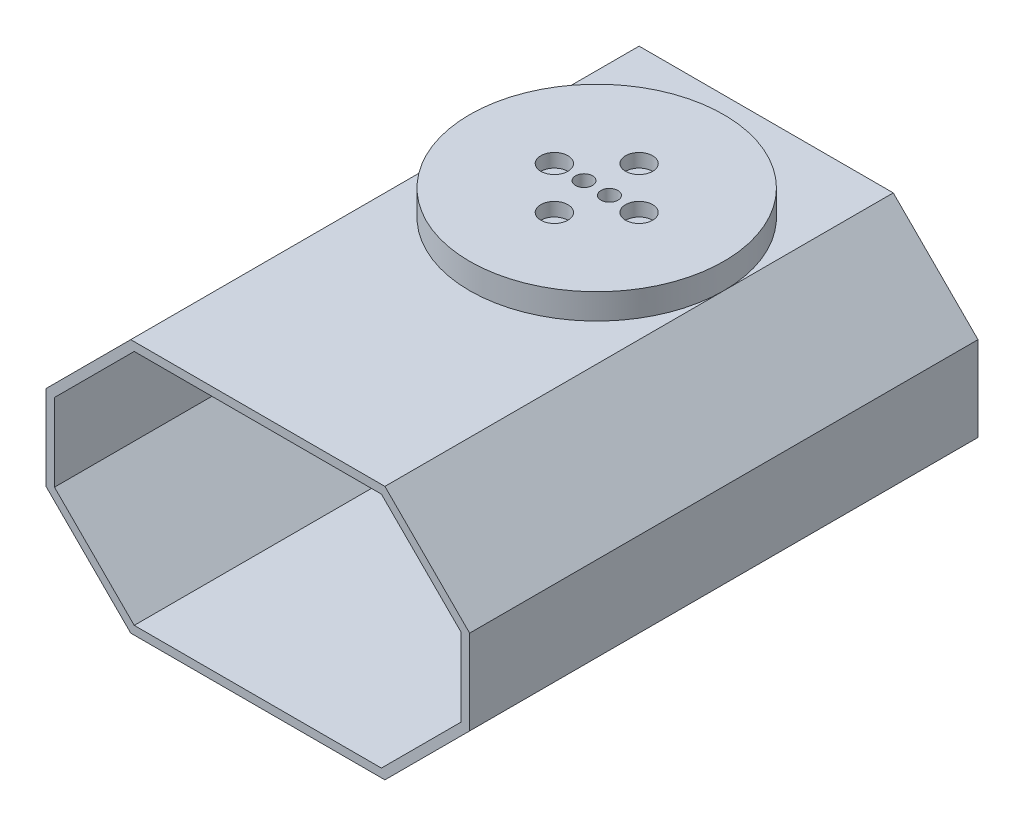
ISO-10303-21;
HEADER;
FILE_DESCRIPTION(('STEP AP214'),'2;1');
FILE_NAME('part.step','',(''),(''),'','','');
FILE_SCHEMA(('AUTOMOTIVE_DESIGN { 1 0 10303 214 1 1 1 1 }'));
ENDSEC;
DATA;
#1=APPLICATION_CONTEXT('core data for automotive mechanical design processes');
#2=APPLICATION_PROTOCOL_DEFINITION('international standard','automotive_design',2000,#1);
#3=PRODUCT_CONTEXT('',#1,'mechanical');
#4=PRODUCT('Part','Part','',(#3));
#5=PRODUCT_RELATED_PRODUCT_CATEGORY('part','',(#4));
#6=PRODUCT_DEFINITION_FORMATION('','',#4);
#7=PRODUCT_DEFINITION_CONTEXT('part definition',#1,'design');
#8=PRODUCT_DEFINITION('design','',#6,#7);
#9=PRODUCT_DEFINITION_SHAPE('','',#8);
#10=(LENGTH_UNIT() NAMED_UNIT(*) SI_UNIT(.MILLI.,.METRE.));
#11=(NAMED_UNIT(*) PLANE_ANGLE_UNIT() SI_UNIT($,.RADIAN.));
#12=(NAMED_UNIT(*) SI_UNIT($,.STERADIAN.) SOLID_ANGLE_UNIT());
#13=UNCERTAINTY_MEASURE_WITH_UNIT(LENGTH_MEASURE(1.E-05),#10,'distance_accuracy_value','');
#14=(GEOMETRIC_REPRESENTATION_CONTEXT(3) GLOBAL_UNCERTAINTY_ASSIGNED_CONTEXT((#13)) GLOBAL_UNIT_ASSIGNED_CONTEXT((#10,
#11,#12)) REPRESENTATION_CONTEXT('',''));
#15=CARTESIAN_POINT('',(0.,0.,0.));
#16=DIRECTION('',(0.,0.,1.));
#17=DIRECTION('',(1.,0.,0.));
#18=AXIS2_PLACEMENT_3D('',#15,#16,#17);
#19=CARTESIAN_POINT('',(0.,0.,0.));
#20=DIRECTION('',(0.,0.,-1.));
#21=DIRECTION('',(-1.,0.,0.));
#22=AXIS2_PLACEMENT_3D('',#19,#20,#21);
#23=PLANE('',#22);
#24=CARTESIAN_POINT('',(0.,10.,0.));
#25=DIRECTION('',(0.,0.,-1.));
#26=DIRECTION('',(-1.,0.,0.));
#27=AXIS2_PLACEMENT_3D('',#24,#25,#26);
#28=CIRCLE('',#27,2.5);
#29=CARTESIAN_POINT('',(-2.5,10.,0.));
#30=VERTEX_POINT('',#29);
#31=EDGE_CURVE('E456',#30,#30,#28,.T.);
#32=ORIENTED_EDGE('',*,*,#31,.F.);
#33=EDGE_LOOP('',(#32));
#34=FACE_BOUND('',#33,.T.);
#35=CARTESIAN_POINT('',(0.,-10.,0.));
#36=DIRECTION('',(0.,0.,-1.));
#37=DIRECTION('',(-1.,0.,0.));
#38=AXIS2_PLACEMENT_3D('',#35,#36,#37);
#39=CIRCLE('',#38,2.5);
#40=CARTESIAN_POINT('',(-2.5,-10.,0.));
#41=VERTEX_POINT('',#40);
#42=EDGE_CURVE('E209',#41,#41,#39,.T.);
#43=ORIENTED_EDGE('',*,*,#42,.F.);
#44=EDGE_LOOP('',(#43));
#45=FACE_BOUND('',#44,.T.);
#46=DIRECTION('',(0.,1.,0.));
#47=VECTOR('',#46,1.);
#48=CARTESIAN_POINT('',(25.,-15.,0.));
#49=LINE('',#48,#47);
#50=CARTESIAN_POINT('',(25.,-5.00000000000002,0.));
#51=VERTEX_POINT('',#50);
#52=CARTESIAN_POINT('',(25.,4.99999999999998,0.));
#53=VERTEX_POINT('',#52);
#54=EDGE_CURVE('E310',#51,#53,#49,.T.);
#55=ORIENTED_EDGE('',*,*,#54,.F.);
#56=DIRECTION('',(0.707106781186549,0.707106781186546,0.));
#57=VECTOR('',#56,1.);
#58=CARTESIAN_POINT('',(15.,-15.,0.));
#59=LINE('',#58,#57);
#60=CARTESIAN_POINT('',(15.,-15.,0.));
#61=VERTEX_POINT('',#60);
#62=EDGE_CURVE('E359',#51,#61,#59,.F.);
#63=ORIENTED_EDGE('',*,*,#62,.T.);
#64=DIRECTION('',(1.,0.,0.));
#65=VECTOR('',#64,1.);
#66=CARTESIAN_POINT('',(-25.,-15.,0.));
#67=LINE('',#66,#65);
#68=CARTESIAN_POINT('',(-15.,-15.,0.));
#69=VERTEX_POINT('',#68);
#70=EDGE_CURVE('E329',#69,#61,#67,.T.);
#71=ORIENTED_EDGE('',*,*,#70,.F.);
#72=DIRECTION('',(0.707106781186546,-0.707106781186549,0.));
#73=VECTOR('',#72,1.);
#74=CARTESIAN_POINT('',(-15.,-15.,0.));
#75=LINE('',#74,#73);
#76=CARTESIAN_POINT('',(-25.,-4.99999999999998,0.));
#77=VERTEX_POINT('',#76);
#78=EDGE_CURVE('E357',#69,#77,#75,.F.);
#79=ORIENTED_EDGE('',*,*,#78,.T.);
#80=DIRECTION('',(0.,-1.,0.));
#81=VECTOR('',#80,1.);
#82=CARTESIAN_POINT('',(-25.,-15.,0.));
#83=LINE('',#82,#81);
#84=CARTESIAN_POINT('',(-25.,5.00000000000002,0.));
#85=VERTEX_POINT('',#84);
#86=EDGE_CURVE('E344',#85,#77,#83,.T.);
#87=ORIENTED_EDGE('',*,*,#86,.F.);
#88=DIRECTION('',(-0.707106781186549,-0.707106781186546,0.));
#89=VECTOR('',#88,1.);
#90=CARTESIAN_POINT('',(-15.,15.,0.));
#91=LINE('',#90,#89);
#92=CARTESIAN_POINT('',(-15.,15.,0.));
#93=VERTEX_POINT('',#92);
#94=EDGE_CURVE('E355',#85,#93,#91,.F.);
#95=ORIENTED_EDGE('',*,*,#94,.T.);
#96=DIRECTION('',(-1.,0.,0.));
#97=VECTOR('',#96,1.);
#98=CARTESIAN_POINT('',(-25.,15.,0.));
#99=LINE('',#98,#97);
#100=CARTESIAN_POINT('',(15.,15.,0.));
#101=VERTEX_POINT('',#100);
#102=EDGE_CURVE('E341',#101,#93,#99,.T.);
#103=ORIENTED_EDGE('',*,*,#102,.F.);
#104=DIRECTION('',(-0.707106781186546,0.707106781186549,0.));
#105=VECTOR('',#104,1.);
#106=CARTESIAN_POINT('',(15.,15.,0.));
#107=LINE('',#106,#105);
#108=EDGE_CURVE('E353',#101,#53,#107,.F.);
#109=ORIENTED_EDGE('',*,*,#108,.T.);
#110=EDGE_LOOP('',(#55,#63,#71,#79,#87,#95,#103,#109));
#111=FACE_BOUND('',#110,.T.);
#112=DIRECTION('',(0.,-1.,0.));
#113=VECTOR('',#112,1.);
#114=CARTESIAN_POINT('',(3.,5.45,0.));
#115=LINE('',#114,#113);
#116=CARTESIAN_POINT('',(3.,5.45,0.));
#117=VERTEX_POINT('',#116);
#118=CARTESIAN_POINT('',(3.,-5.45,0.));
#119=VERTEX_POINT('',#118);
#120=EDGE_CURVE('E202',#117,#119,#115,.T.);
#121=ORIENTED_EDGE('',*,*,#120,.F.);
#122=DIRECTION('',(-1.,0.,0.));
#123=VECTOR('',#122,1.);
#124=CARTESIAN_POINT('',(3.,5.45,0.));
#125=LINE('',#124,#123);
#126=CARTESIAN_POINT('',(-3.,5.45,0.));
#127=VERTEX_POINT('',#126);
#128=EDGE_CURVE('E57',#117,#127,#125,.T.);
#129=ORIENTED_EDGE('',*,*,#128,.T.);
#130=DIRECTION('',(0.,-1.,0.));
#131=VECTOR('',#130,1.);
#132=CARTESIAN_POINT('',(-3.,5.45,0.));
#133=LINE('',#132,#131);
#134=CARTESIAN_POINT('',(-3.,-5.45,0.));
#135=VERTEX_POINT('',#134);
#136=EDGE_CURVE('E193',#127,#135,#133,.T.);
#137=ORIENTED_EDGE('',*,*,#136,.T.);
#138=DIRECTION('',(-1.,0.,0.));
#139=VECTOR('',#138,1.);
#140=CARTESIAN_POINT('',(3.,-5.45,0.));
#141=LINE('',#140,#139);
#142=EDGE_CURVE('E199',#119,#135,#141,.T.);
#143=ORIENTED_EDGE('',*,*,#142,.F.);
#144=EDGE_LOOP('',(#121,#129,#137,#143));
#145=FACE_BOUND('',#144,.T.);
#146=ADVANCED_FACE('F41',(#34,#45,#111,#145),#23,.T.);
#147=CARTESIAN_POINT('',(0.,0.,2.));
#148=DIRECTION('',(0.,0.,1.));
#149=DIRECTION('',(1.,0.,0.));
#150=AXIS2_PLACEMENT_3D('',#147,#148,#149);
#151=PLANE('',#150);
#152=DIRECTION('',(1.,0.,0.));
#153=VECTOR('',#152,1.);
#154=CARTESIAN_POINT('',(14.5857864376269,-14.,2.));
#155=LINE('',#154,#153);
#156=CARTESIAN_POINT('',(-14.5857864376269,-14.,2.));
#157=VERTEX_POINT('',#156);
#158=CARTESIAN_POINT('',(14.5857864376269,-14.,2.));
#159=VERTEX_POINT('',#158);
#160=EDGE_CURVE('E261',#157,#159,#155,.T.);
#161=ORIENTED_EDGE('',*,*,#160,.T.);
#162=DIRECTION('',(0.707106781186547,0.707106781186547,0.));
#163=VECTOR('',#162,1.);
#164=CARTESIAN_POINT('',(24.,-4.58578643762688,2.));
#165=LINE('',#164,#163);
#166=CARTESIAN_POINT('',(24.,-4.58578643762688,2.));
#167=VERTEX_POINT('',#166);
#168=EDGE_CURVE('E264',#159,#167,#165,.T.);
#169=ORIENTED_EDGE('',*,*,#168,.T.);
#170=DIRECTION('',(0.,1.,0.));
#171=VECTOR('',#170,1.);
#172=CARTESIAN_POINT('',(24.,4.58578643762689,2.));
#173=LINE('',#172,#171);
#174=CARTESIAN_POINT('',(24.,4.58578643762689,2.));
#175=VERTEX_POINT('',#174);
#176=EDGE_CURVE('E268',#167,#175,#173,.T.);
#177=ORIENTED_EDGE('',*,*,#176,.T.);
#178=DIRECTION('',(-0.707106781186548,0.707106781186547,0.));
#179=VECTOR('',#178,1.);
#180=CARTESIAN_POINT('',(14.5857864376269,14.,2.));
#181=LINE('',#180,#179);
#182=CARTESIAN_POINT('',(14.5857864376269,14.,2.));
#183=VERTEX_POINT('',#182);
#184=EDGE_CURVE('E271',#175,#183,#181,.T.);
#185=ORIENTED_EDGE('',*,*,#184,.T.);
#186=DIRECTION('',(-1.,0.,0.));
#187=VECTOR('',#186,1.);
#188=CARTESIAN_POINT('',(-14.5857864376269,14.,2.));
#189=LINE('',#188,#187);
#190=CARTESIAN_POINT('',(-14.5857864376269,14.,2.));
#191=VERTEX_POINT('',#190);
#192=EDGE_CURVE('E274',#183,#191,#189,.T.);
#193=ORIENTED_EDGE('',*,*,#192,.T.);
#194=DIRECTION('',(-0.707106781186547,-0.707106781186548,0.));
#195=VECTOR('',#194,1.);
#196=CARTESIAN_POINT('',(-24.,4.58578643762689,2.));
#197=LINE('',#196,#195);
#198=CARTESIAN_POINT('',(-24.,4.58578643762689,2.));
#199=VERTEX_POINT('',#198);
#200=EDGE_CURVE('E277',#191,#199,#197,.T.);
#201=ORIENTED_EDGE('',*,*,#200,.T.);
#202=DIRECTION('',(0.,-1.,0.));
#203=VECTOR('',#202,1.);
#204=CARTESIAN_POINT('',(-24.,4.58578643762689,2.));
#205=LINE('',#204,#203);
#206=CARTESIAN_POINT('',(-24.,-4.5857864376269,2.));
#207=VERTEX_POINT('',#206);
#208=EDGE_CURVE('E280',#199,#207,#205,.T.);
#209=ORIENTED_EDGE('',*,*,#208,.T.);
#210=DIRECTION('',(0.707106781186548,-0.707106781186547,0.));
#211=VECTOR('',#210,1.);
#212=CARTESIAN_POINT('',(-14.5857864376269,-14.,2.));
#213=LINE('',#212,#211);
#214=EDGE_CURVE('E283',#207,#157,#213,.T.);
#215=ORIENTED_EDGE('',*,*,#214,.T.);
#216=EDGE_LOOP('',(#161,#169,#177,#185,#193,#201,#209,#215));
#217=FACE_BOUND('',#216,.T.);
#218=DIRECTION('',(0.,1.,0.));
#219=VECTOR('',#218,1.);
#220=CARTESIAN_POINT('',(-3.,0.,2.));
#221=LINE('',#220,#219);
#222=CARTESIAN_POINT('',(-3.,-5.45,2.));
#223=VERTEX_POINT('',#222);
#224=CARTESIAN_POINT('',(-3.,5.45,2.));
#225=VERTEX_POINT('',#224);
#226=EDGE_CURVE('E50',#223,#225,#221,.T.);
#227=ORIENTED_EDGE('',*,*,#226,.T.);
#228=DIRECTION('',(1.,0.,0.));
#229=VECTOR('',#228,1.);
#230=CARTESIAN_POINT('',(0.,5.45,2.));
#231=LINE('',#230,#229);
#232=CARTESIAN_POINT('',(3.,5.45,2.));
#233=VERTEX_POINT('',#232);
#234=EDGE_CURVE('E11',#225,#233,#231,.T.);
#235=ORIENTED_EDGE('',*,*,#234,.T.);
#236=DIRECTION('',(0.,1.,0.));
#237=VECTOR('',#236,1.);
#238=CARTESIAN_POINT('',(3.,0.,2.));
#239=LINE('',#238,#237);
#240=CARTESIAN_POINT('',(3.,-5.45,2.));
#241=VERTEX_POINT('',#240);
#242=EDGE_CURVE('E386',#241,#233,#239,.T.);
#243=ORIENTED_EDGE('',*,*,#242,.F.);
#244=DIRECTION('',(1.,0.,0.));
#245=VECTOR('',#244,1.);
#246=CARTESIAN_POINT('',(0.,-5.45,2.));
#247=LINE('',#246,#245);
#248=EDGE_CURVE('E388',#223,#241,#247,.T.);
#249=ORIENTED_EDGE('',*,*,#248,.F.);
#250=EDGE_LOOP('',(#227,#235,#243,#249));
#251=FACE_BOUND('',#250,.T.);
#252=ADVANCED_FACE('F391',(#217,#251),#151,.T.);
#253=CARTESIAN_POINT('',(-25.,15.,60.));
#254=DIRECTION('',(0.,-1.,0.));
#255=DIRECTION('',(0.,0.,-1.));
#256=AXIS2_PLACEMENT_3D('',#253,#254,#255);
#257=PLANE('',#256);
#258=CARTESIAN_POINT('',(0.,15.,20.));
#259=DIRECTION('',(0.,1.,0.));
#260=DIRECTION('',(0.,0.,1.));
#261=AXIS2_PLACEMENT_3D('',#258,#259,#260);
#262=CIRCLE('',#261,15.);
#263=CARTESIAN_POINT('',(15.,15.,20.));
#264=VERTEX_POINT('',#263);
#265=CARTESIAN_POINT('',(-15.,15.,20.));
#266=VERTEX_POINT('',#265);
#267=EDGE_CURVE('E253',#264,#266,#262,.T.);
#268=ORIENTED_EDGE('',*,*,#267,.F.);
#269=DIRECTION('',(0.,0.,-1.));
#270=VECTOR('',#269,1.);
#271=CARTESIAN_POINT('',(15.,15.,60.));
#272=LINE('',#271,#270);
#273=EDGE_CURVE('E379',#264,#101,#272,.T.);
#274=ORIENTED_EDGE('',*,*,#273,.T.);
#275=ORIENTED_EDGE('',*,*,#102,.T.);
#276=DIRECTION('',(0.,0.,1.));
#277=VECTOR('',#276,1.);
#278=CARTESIAN_POINT('',(-15.,15.,60.));
#279=LINE('',#278,#277);
#280=EDGE_CURVE('E383',#93,#266,#279,.T.);
#281=ORIENTED_EDGE('',*,*,#280,.T.);
#282=EDGE_LOOP('',(#268,#274,#275,#281));
#283=FACE_BOUND('',#282,.T.);
#284=ADVANCED_FACE('F415',(#283),#257,.F.);
#285=CARTESIAN_POINT('',(25.,-15.,60.));
#286=DIRECTION('',(-1.,0.,0.));
#287=DIRECTION('',(0.,0.,1.));
#288=AXIS2_PLACEMENT_3D('',#285,#286,#287);
#289=PLANE('',#288);
#290=DIRECTION('',(0.,1.,0.));
#291=VECTOR('',#290,1.);
#292=CARTESIAN_POINT('',(25.,-15.,60.));
#293=LINE('',#292,#291);
#294=CARTESIAN_POINT('',(25.,-5.00000000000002,60.));
#295=VERTEX_POINT('',#294);
#296=CARTESIAN_POINT('',(25.,4.99999999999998,60.));
#297=VERTEX_POINT('',#296);
#298=EDGE_CURVE('E325',#295,#297,#293,.T.);
#299=ORIENTED_EDGE('',*,*,#298,.F.);
#300=DIRECTION('',(0.,0.,-1.));
#301=VECTOR('',#300,1.);
#302=CARTESIAN_POINT('',(25.,-5.00000000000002,60.));
#303=LINE('',#302,#301);
#304=EDGE_CURVE('E350',#295,#51,#303,.T.);
#305=ORIENTED_EDGE('',*,*,#304,.T.);
#306=ORIENTED_EDGE('',*,*,#54,.T.);
#307=DIRECTION('',(0.,0.,1.));
#308=VECTOR('',#307,1.);
#309=CARTESIAN_POINT('',(25.,4.99999999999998,60.));
#310=LINE('',#309,#308);
#311=EDGE_CURVE('E338',#53,#297,#310,.T.);
#312=ORIENTED_EDGE('',*,*,#311,.T.);
#313=EDGE_LOOP('',(#299,#305,#306,#312));
#314=FACE_BOUND('',#313,.T.);
#315=ADVANCED_FACE('F480',(#314),#289,.F.);
#316=EDGE_CURVE('E260',#266,#264,#262,.T.);
#317=ORIENTED_EDGE('',*,*,#316,.F.);
#318=CARTESIAN_POINT('',(-15.,15.,60.));
#319=VERTEX_POINT('',#318);
#320=EDGE_CURVE('E382',#266,#319,#279,.T.);
#321=ORIENTED_EDGE('',*,*,#320,.T.);
#322=DIRECTION('',(-1.,0.,0.));
#323=VECTOR('',#322,1.);
#324=CARTESIAN_POINT('',(-25.,15.,60.));
#325=LINE('',#324,#323);
#326=CARTESIAN_POINT('',(15.,15.,60.));
#327=VERTEX_POINT('',#326);
#328=EDGE_CURVE('E328',#327,#319,#325,.T.);
#329=ORIENTED_EDGE('',*,*,#328,.F.);
#330=EDGE_CURVE('E380',#327,#264,#272,.T.);
#331=ORIENTED_EDGE('',*,*,#330,.T.);
#332=EDGE_LOOP('',(#317,#321,#329,#331));
#333=FACE_BOUND('',#332,.T.);
#334=ADVANCED_FACE('F491',(#333),#257,.F.);
#335=CARTESIAN_POINT('',(-25.,-15.,60.));
#336=DIRECTION('',(1.,0.,0.));
#337=DIRECTION('',(0.,0.,-1.));
#338=AXIS2_PLACEMENT_3D('',#335,#336,#337);
#339=PLANE('',#338);
#340=ORIENTED_EDGE('',*,*,#86,.T.);
#341=DIRECTION('',(0.,0.,1.));
#342=VECTOR('',#341,1.);
#343=CARTESIAN_POINT('',(-25.,-4.99999999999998,60.));
#344=LINE('',#343,#342);
#345=CARTESIAN_POINT('',(-25.,-4.99999999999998,60.));
#346=VERTEX_POINT('',#345);
#347=EDGE_CURVE('E377',#77,#346,#344,.T.);
#348=ORIENTED_EDGE('',*,*,#347,.T.);
#349=DIRECTION('',(0.,-1.,0.));
#350=VECTOR('',#349,1.);
#351=CARTESIAN_POINT('',(-25.,-15.,60.));
#352=LINE('',#351,#350);
#353=CARTESIAN_POINT('',(-25.,5.00000000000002,60.));
#354=VERTEX_POINT('',#353);
#355=EDGE_CURVE('E332',#354,#346,#352,.T.);
#356=ORIENTED_EDGE('',*,*,#355,.F.);
#357=DIRECTION('',(0.,0.,-1.));
#358=VECTOR('',#357,1.);
#359=CARTESIAN_POINT('',(-25.,5.00000000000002,60.));
#360=LINE('',#359,#358);
#361=EDGE_CURVE('E374',#354,#85,#360,.T.);
#362=ORIENTED_EDGE('',*,*,#361,.T.);
#363=EDGE_LOOP('',(#340,#348,#356,#362));
#364=FACE_BOUND('',#363,.T.);
#365=ADVANCED_FACE('F557',(#364),#339,.F.);
#366=CARTESIAN_POINT('',(-25.,-15.,60.));
#367=DIRECTION('',(0.,1.,0.));
#368=DIRECTION('',(0.,0.,1.));
#369=AXIS2_PLACEMENT_3D('',#366,#367,#368);
#370=PLANE('',#369);
#371=ORIENTED_EDGE('',*,*,#70,.T.);
#372=DIRECTION('',(0.,0.,1.));
#373=VECTOR('',#372,1.);
#374=CARTESIAN_POINT('',(15.,-15.,60.));
#375=LINE('',#374,#373);
#376=CARTESIAN_POINT('',(15.,-15.,60.));
#377=VERTEX_POINT('',#376);
#378=EDGE_CURVE('E364',#61,#377,#375,.T.);
#379=ORIENTED_EDGE('',*,*,#378,.T.);
#380=DIRECTION('',(1.,0.,0.));
#381=VECTOR('',#380,1.);
#382=CARTESIAN_POINT('',(-25.,-15.,60.));
#383=LINE('',#382,#381);
#384=CARTESIAN_POINT('',(-15.,-15.,60.));
#385=VERTEX_POINT('',#384);
#386=EDGE_CURVE('E335',#385,#377,#383,.T.);
#387=ORIENTED_EDGE('',*,*,#386,.F.);
#388=DIRECTION('',(0.,0.,-1.));
#389=VECTOR('',#388,1.);
#390=CARTESIAN_POINT('',(-15.,-15.,60.));
#391=LINE('',#390,#389);
#392=EDGE_CURVE('E361',#385,#69,#391,.T.);
#393=ORIENTED_EDGE('',*,*,#392,.T.);
#394=EDGE_LOOP('',(#371,#379,#387,#393));
#395=FACE_BOUND('',#394,.T.);
#396=ADVANCED_FACE('F548',(#395),#370,.F.);
#397=CARTESIAN_POINT('',(0.,0.,60.));
#398=DIRECTION('',(0.,0.,-1.));
#399=DIRECTION('',(-1.,0.,0.));
#400=AXIS2_PLACEMENT_3D('',#397,#398,#399);
#401=PLANE('',#400);
#402=DIRECTION('',(0.707106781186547,0.707106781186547,0.));
#403=VECTOR('',#402,1.);
#404=CARTESIAN_POINT('',(24.,-4.58578643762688,60.));
#405=LINE('',#404,#403);
#406=CARTESIAN_POINT('',(14.5857864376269,-14.,60.));
#407=VERTEX_POINT('',#406);
#408=CARTESIAN_POINT('',(24.,-4.58578643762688,60.));
#409=VERTEX_POINT('',#408);
#410=EDGE_CURVE('E288',#407,#409,#405,.T.);
#411=ORIENTED_EDGE('',*,*,#410,.F.);
#412=DIRECTION('',(1.,0.,0.));
#413=VECTOR('',#412,1.);
#414=CARTESIAN_POINT('',(14.5857864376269,-14.,60.));
#415=LINE('',#414,#413);
#416=CARTESIAN_POINT('',(-14.5857864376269,-14.,60.));
#417=VERTEX_POINT('',#416);
#418=EDGE_CURVE('E257',#417,#407,#415,.T.);
#419=ORIENTED_EDGE('',*,*,#418,.F.);
#420=DIRECTION('',(0.707106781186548,-0.707106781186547,0.));
#421=VECTOR('',#420,1.);
#422=CARTESIAN_POINT('',(-14.5857864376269,-14.,60.));
#423=LINE('',#422,#421);
#424=CARTESIAN_POINT('',(-24.,-4.5857864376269,60.));
#425=VERTEX_POINT('',#424);
#426=EDGE_CURVE('E265',#425,#417,#423,.T.);
#427=ORIENTED_EDGE('',*,*,#426,.F.);
#428=DIRECTION('',(0.,-1.,0.));
#429=VECTOR('',#428,1.);
#430=CARTESIAN_POINT('',(-24.,4.58578643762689,60.));
#431=LINE('',#430,#429);
#432=CARTESIAN_POINT('',(-24.,4.58578643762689,60.));
#433=VERTEX_POINT('',#432);
#434=EDGE_CURVE('E303',#433,#425,#431,.T.);
#435=ORIENTED_EDGE('',*,*,#434,.F.);
#436=DIRECTION('',(-0.707106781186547,-0.707106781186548,0.));
#437=VECTOR('',#436,1.);
#438=CARTESIAN_POINT('',(-24.,4.58578643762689,60.));
#439=LINE('',#438,#437);
#440=CARTESIAN_POINT('',(-14.5857864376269,14.,60.));
#441=VERTEX_POINT('',#440);
#442=EDGE_CURVE('E300',#441,#433,#439,.T.);
#443=ORIENTED_EDGE('',*,*,#442,.F.);
#444=DIRECTION('',(-1.,0.,0.));
#445=VECTOR('',#444,1.);
#446=CARTESIAN_POINT('',(-14.5857864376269,14.,60.));
#447=LINE('',#446,#445);
#448=CARTESIAN_POINT('',(14.5857864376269,14.,60.));
#449=VERTEX_POINT('',#448);
#450=EDGE_CURVE('E297',#449,#441,#447,.T.);
#451=ORIENTED_EDGE('',*,*,#450,.F.);
#452=DIRECTION('',(-0.707106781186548,0.707106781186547,0.));
#453=VECTOR('',#452,1.);
#454=CARTESIAN_POINT('',(14.5857864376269,14.,60.));
#455=LINE('',#454,#453);
#456=CARTESIAN_POINT('',(24.,4.58578643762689,60.));
#457=VERTEX_POINT('',#456);
#458=EDGE_CURVE('E294',#457,#449,#455,.T.);
#459=ORIENTED_EDGE('',*,*,#458,.F.);
#460=DIRECTION('',(0.,1.,0.));
#461=VECTOR('',#460,1.);
#462=CARTESIAN_POINT('',(24.,4.58578643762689,60.));
#463=LINE('',#462,#461);
#464=EDGE_CURVE('E291',#409,#457,#463,.T.);
#465=ORIENTED_EDGE('',*,*,#464,.F.);
#466=EDGE_LOOP('',(#411,#419,#427,#435,#443,#451,#459,#465));
#467=FACE_BOUND('',#466,.T.);
#468=ORIENTED_EDGE('',*,*,#386,.T.);
#469=DIRECTION('',(-0.707106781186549,-0.707106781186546,0.));
#470=VECTOR('',#469,1.);
#471=CARTESIAN_POINT('',(25.,-5.00000000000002,60.));
#472=LINE('',#471,#470);
#473=EDGE_CURVE('E372',#377,#295,#472,.F.);
#474=ORIENTED_EDGE('',*,*,#473,.T.);
#475=ORIENTED_EDGE('',*,*,#298,.T.);
#476=DIRECTION('',(0.707106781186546,-0.707106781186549,0.));
#477=VECTOR('',#476,1.);
#478=CARTESIAN_POINT('',(15.,15.,60.));
#479=LINE('',#478,#477);
#480=EDGE_CURVE('E366',#297,#327,#479,.F.);
#481=ORIENTED_EDGE('',*,*,#480,.T.);
#482=ORIENTED_EDGE('',*,*,#328,.T.);
#483=DIRECTION('',(0.707106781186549,0.707106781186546,0.));
#484=VECTOR('',#483,1.);
#485=CARTESIAN_POINT('',(-25.,5.00000000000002,60.));
#486=LINE('',#485,#484);
#487=EDGE_CURVE('E368',#319,#354,#486,.F.);
#488=ORIENTED_EDGE('',*,*,#487,.T.);
#489=ORIENTED_EDGE('',*,*,#355,.T.);
#490=DIRECTION('',(-0.707106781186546,0.707106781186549,0.));
#491=VECTOR('',#490,1.);
#492=CARTESIAN_POINT('',(-15.,-15.,60.));
#493=LINE('',#492,#491);
#494=EDGE_CURVE('E370',#346,#385,#493,.F.);
#495=ORIENTED_EDGE('',*,*,#494,.T.);
#496=EDGE_LOOP('',(#468,#474,#475,#481,#482,#488,#489,#495));
#497=FACE_BOUND('',#496,.T.);
#498=ADVANCED_FACE('F488',(#467,#497),#401,.F.);
#499=CARTESIAN_POINT('',(25.,-5.00000000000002,60.));
#500=DIRECTION('',(-0.707106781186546,0.707106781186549,0.));
#501=DIRECTION('',(0.,0.,-1.));
#502=AXIS2_PLACEMENT_3D('',#499,#500,#501);
#503=PLANE('',#502);
#504=ORIENTED_EDGE('',*,*,#473,.F.);
#505=ORIENTED_EDGE('',*,*,#378,.F.);
#506=ORIENTED_EDGE('',*,*,#62,.F.);
#507=ORIENTED_EDGE('',*,*,#304,.F.);
#508=EDGE_LOOP('',(#504,#505,#506,#507));
#509=FACE_BOUND('',#508,.T.);
#510=ADVANCED_FACE('F547',(#509),#503,.F.);
#511=CARTESIAN_POINT('',(-15.,-15.,60.));
#512=DIRECTION('',(0.707106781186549,0.707106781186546,0.));
#513=DIRECTION('',(0.,0.,-1.));
#514=AXIS2_PLACEMENT_3D('',#511,#512,#513);
#515=PLANE('',#514);
#516=ORIENTED_EDGE('',*,*,#494,.F.);
#517=ORIENTED_EDGE('',*,*,#347,.F.);
#518=ORIENTED_EDGE('',*,*,#78,.F.);
#519=ORIENTED_EDGE('',*,*,#392,.F.);
#520=EDGE_LOOP('',(#516,#517,#518,#519));
#521=FACE_BOUND('',#520,.T.);
#522=ADVANCED_FACE('F554',(#521),#515,.F.);
#523=CARTESIAN_POINT('',(-25.,5.00000000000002,60.));
#524=DIRECTION('',(0.707106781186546,-0.707106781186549,0.));
#525=DIRECTION('',(0.,0.,-1.));
#526=AXIS2_PLACEMENT_3D('',#523,#524,#525);
#527=PLANE('',#526);
#528=ORIENTED_EDGE('',*,*,#487,.F.);
#529=ORIENTED_EDGE('',*,*,#320,.F.);
#530=ORIENTED_EDGE('',*,*,#280,.F.);
#531=ORIENTED_EDGE('',*,*,#94,.F.);
#532=ORIENTED_EDGE('',*,*,#361,.F.);
#533=EDGE_LOOP('',(#528,#529,#530,#531,#532));
#534=FACE_BOUND('',#533,.T.);
#535=ADVANCED_FACE('F496',(#534),#527,.F.);
#536=CARTESIAN_POINT('',(15.,15.,60.));
#537=DIRECTION('',(-0.707106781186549,-0.707106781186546,0.));
#538=DIRECTION('',(0.,0.,-1.));
#539=AXIS2_PLACEMENT_3D('',#536,#537,#538);
#540=PLANE('',#539);
#541=ORIENTED_EDGE('',*,*,#480,.F.);
#542=ORIENTED_EDGE('',*,*,#311,.F.);
#543=ORIENTED_EDGE('',*,*,#108,.F.);
#544=ORIENTED_EDGE('',*,*,#273,.F.);
#545=ORIENTED_EDGE('',*,*,#330,.F.);
#546=EDGE_LOOP('',(#541,#542,#543,#544,#545));
#547=FACE_BOUND('',#546,.T.);
#548=ADVANCED_FACE('F44',(#547),#540,.F.);
#549=CARTESIAN_POINT('',(14.5857864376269,-14.,2.));
#550=DIRECTION('',(0.,-1.,0.));
#551=DIRECTION('',(1.,0.,0.));
#552=AXIS2_PLACEMENT_3D('',#549,#550,#551);
#553=PLANE('',#552);
#554=ORIENTED_EDGE('',*,*,#418,.T.);
#555=DIRECTION('',(0.,0.,1.));
#556=VECTOR('',#555,1.);
#557=CARTESIAN_POINT('',(14.5857864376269,-14.,2.));
#558=LINE('',#557,#556);
#559=EDGE_CURVE('E286',#159,#407,#558,.T.);
#560=ORIENTED_EDGE('',*,*,#559,.F.);
#561=ORIENTED_EDGE('',*,*,#160,.F.);
#562=DIRECTION('',(0.,0.,1.));
#563=VECTOR('',#562,1.);
#564=CARTESIAN_POINT('',(-14.5857864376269,-14.,2.));
#565=LINE('',#564,#563);
#566=EDGE_CURVE('E308',#157,#417,#565,.T.);
#567=ORIENTED_EDGE('',*,*,#566,.T.);
#568=EDGE_LOOP('',(#554,#560,#561,#567));
#569=FACE_BOUND('',#568,.T.);
#570=ADVANCED_FACE('F524',(#569),#553,.F.);
#571=CARTESIAN_POINT('',(-14.5857864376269,-14.,2.));
#572=DIRECTION('',(-0.707106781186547,-0.707106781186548,0.));
#573=DIRECTION('',(0.707106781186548,-0.707106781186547,0.));
#574=AXIS2_PLACEMENT_3D('',#571,#572,#573);
#575=PLANE('',#574);
#576=ORIENTED_EDGE('',*,*,#426,.T.);
#577=ORIENTED_EDGE('',*,*,#566,.F.);
#578=ORIENTED_EDGE('',*,*,#214,.F.);
#579=DIRECTION('',(0.,0.,1.));
#580=VECTOR('',#579,1.);
#581=CARTESIAN_POINT('',(-24.,-4.5857864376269,2.));
#582=LINE('',#581,#580);
#583=EDGE_CURVE('E311',#207,#425,#582,.T.);
#584=ORIENTED_EDGE('',*,*,#583,.T.);
#585=EDGE_LOOP('',(#576,#577,#578,#584));
#586=FACE_BOUND('',#585,.T.);
#587=ADVANCED_FACE('F520',(#586),#575,.F.);
#588=CARTESIAN_POINT('',(-24.,4.58578643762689,2.));
#589=DIRECTION('',(-1.,0.,0.));
#590=DIRECTION('',(0.,0.,1.));
#591=AXIS2_PLACEMENT_3D('',#588,#589,#590);
#592=PLANE('',#591);
#593=ORIENTED_EDGE('',*,*,#434,.T.);
#594=ORIENTED_EDGE('',*,*,#583,.F.);
#595=ORIENTED_EDGE('',*,*,#208,.F.);
#596=DIRECTION('',(0.,0.,1.));
#597=VECTOR('',#596,1.);
#598=CARTESIAN_POINT('',(-24.,4.58578643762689,2.));
#599=LINE('',#598,#597);
#600=EDGE_CURVE('E313',#199,#433,#599,.T.);
#601=ORIENTED_EDGE('',*,*,#600,.T.);
#602=EDGE_LOOP('',(#593,#594,#595,#601));
#603=FACE_BOUND('',#602,.T.);
#604=ADVANCED_FACE('F523',(#603),#592,.F.);
#605=CARTESIAN_POINT('',(-24.,4.58578643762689,2.));
#606=DIRECTION('',(-0.707106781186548,0.707106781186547,0.));
#607=DIRECTION('',(-0.707106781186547,-0.707106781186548,0.));
#608=AXIS2_PLACEMENT_3D('',#605,#606,#607);
#609=PLANE('',#608);
#610=ORIENTED_EDGE('',*,*,#442,.T.);
#611=ORIENTED_EDGE('',*,*,#600,.F.);
#612=ORIENTED_EDGE('',*,*,#200,.F.);
#613=DIRECTION('',(0.,0.,1.));
#614=VECTOR('',#613,1.);
#615=CARTESIAN_POINT('',(-14.5857864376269,14.,2.));
#616=LINE('',#615,#614);
#617=EDGE_CURVE('E315',#191,#441,#616,.T.);
#618=ORIENTED_EDGE('',*,*,#617,.T.);
#619=EDGE_LOOP('',(#610,#611,#612,#618));
#620=FACE_BOUND('',#619,.T.);
#621=ADVANCED_FACE('F528',(#620),#609,.F.);
#622=CARTESIAN_POINT('',(-14.5857864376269,14.,2.));
#623=DIRECTION('',(0.,1.,0.));
#624=DIRECTION('',(-1.,0.,0.));
#625=AXIS2_PLACEMENT_3D('',#622,#623,#624);
#626=PLANE('',#625);
#627=CARTESIAN_POINT('',(-1.5,14.,20.));
#628=DIRECTION('',(0.,1.,0.));
#629=DIRECTION('',(-1.,0.,0.));
#630=AXIS2_PLACEMENT_3D('',#627,#628,#629);
#631=CIRCLE('',#630,1.);
#632=CARTESIAN_POINT('',(-2.5,14.,20.));
#633=VERTEX_POINT('',#632);
#634=EDGE_CURVE('E250',#633,#633,#631,.T.);
#635=ORIENTED_EDGE('',*,*,#634,.T.);
#636=EDGE_LOOP('',(#635));
#637=FACE_BOUND('',#636,.T.);
#638=CARTESIAN_POINT('',(1.5,14.,20.));
#639=DIRECTION('',(0.,1.,0.));
#640=DIRECTION('',(-1.,0.,0.));
#641=AXIS2_PLACEMENT_3D('',#638,#639,#640);
#642=CIRCLE('',#641,1.);
#643=CARTESIAN_POINT('',(0.499999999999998,14.,20.));
#644=VERTEX_POINT('',#643);
#645=EDGE_CURVE('E245',#644,#644,#642,.T.);
#646=ORIENTED_EDGE('',*,*,#645,.T.);
#647=EDGE_LOOP('',(#646));
#648=FACE_BOUND('',#647,.T.);
#649=ORIENTED_EDGE('',*,*,#450,.T.);
#650=ORIENTED_EDGE('',*,*,#617,.F.);
#651=ORIENTED_EDGE('',*,*,#192,.F.);
#652=DIRECTION('',(0.,0.,1.));
#653=VECTOR('',#652,1.);
#654=CARTESIAN_POINT('',(14.5857864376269,14.,2.));
#655=LINE('',#654,#653);
#656=EDGE_CURVE('E317',#183,#449,#655,.T.);
#657=ORIENTED_EDGE('',*,*,#656,.T.);
#658=EDGE_LOOP('',(#649,#650,#651,#657));
#659=FACE_BOUND('',#658,.T.);
#660=ADVANCED_FACE('F532',(#637,#648,#659),#626,.F.);
#661=CARTESIAN_POINT('',(14.5857864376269,14.,2.));
#662=DIRECTION('',(0.707106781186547,0.707106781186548,0.));
#663=DIRECTION('',(-0.707106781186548,0.707106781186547,0.));
#664=AXIS2_PLACEMENT_3D('',#661,#662,#663);
#665=PLANE('',#664);
#666=ORIENTED_EDGE('',*,*,#458,.T.);
#667=ORIENTED_EDGE('',*,*,#656,.F.);
#668=ORIENTED_EDGE('',*,*,#184,.F.);
#669=DIRECTION('',(0.,0.,1.));
#670=VECTOR('',#669,1.);
#671=CARTESIAN_POINT('',(24.,4.58578643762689,2.));
#672=LINE('',#671,#670);
#673=EDGE_CURVE('E319',#175,#457,#672,.T.);
#674=ORIENTED_EDGE('',*,*,#673,.T.);
#675=EDGE_LOOP('',(#666,#667,#668,#674));
#676=FACE_BOUND('',#675,.T.);
#677=ADVANCED_FACE('F536',(#676),#665,.F.);
#678=CARTESIAN_POINT('',(24.,4.58578643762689,2.));
#679=DIRECTION('',(1.,0.,0.));
#680=DIRECTION('',(0.,0.,-1.));
#681=AXIS2_PLACEMENT_3D('',#678,#679,#680);
#682=PLANE('',#681);
#683=ORIENTED_EDGE('',*,*,#464,.T.);
#684=ORIENTED_EDGE('',*,*,#673,.F.);
#685=ORIENTED_EDGE('',*,*,#176,.F.);
#686=DIRECTION('',(0.,0.,1.));
#687=VECTOR('',#686,1.);
#688=CARTESIAN_POINT('',(24.,-4.58578643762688,2.));
#689=LINE('',#688,#687);
#690=EDGE_CURVE('E321',#167,#409,#689,.T.);
#691=ORIENTED_EDGE('',*,*,#690,.T.);
#692=EDGE_LOOP('',(#683,#684,#685,#691));
#693=FACE_BOUND('',#692,.T.);
#694=ADVANCED_FACE('F514',(#693),#682,.F.);
#695=CARTESIAN_POINT('',(24.,-4.58578643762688,2.));
#696=DIRECTION('',(0.707106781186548,-0.707106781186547,0.));
#697=DIRECTION('',(0.707106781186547,0.707106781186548,0.));
#698=AXIS2_PLACEMENT_3D('',#695,#696,#697);
#699=PLANE('',#698);
#700=ORIENTED_EDGE('',*,*,#410,.T.);
#701=ORIENTED_EDGE('',*,*,#690,.F.);
#702=ORIENTED_EDGE('',*,*,#168,.F.);
#703=ORIENTED_EDGE('',*,*,#559,.T.);
#704=EDGE_LOOP('',(#700,#701,#702,#703));
#705=FACE_BOUND('',#704,.T.);
#706=ADVANCED_FACE('F504',(#705),#699,.F.);
#707=CARTESIAN_POINT('',(0.,18.,20.));
#708=DIRECTION('',(0.,-1.,0.));
#709=DIRECTION('',(0.,0.,-1.));
#710=AXIS2_PLACEMENT_3D('',#707,#708,#709);
#711=CYLINDRICAL_SURFACE('',#710,15.);
#712=CARTESIAN_POINT('',(0.,18.,20.));
#713=DIRECTION('',(0.,1.,0.));
#714=DIRECTION('',(0.,0.,1.));
#715=AXIS2_PLACEMENT_3D('',#712,#713,#714);
#716=CIRCLE('',#715,15.);
#717=CARTESIAN_POINT('',(0.,18.,35.));
#718=VERTEX_POINT('',#717);
#719=EDGE_CURVE('E254',#718,#718,#716,.T.);
#720=ORIENTED_EDGE('',*,*,#719,.F.);
#721=EDGE_LOOP('',(#720));
#722=FACE_BOUND('',#721,.T.);
#723=ORIENTED_EDGE('',*,*,#267,.T.);
#724=ORIENTED_EDGE('',*,*,#316,.T.);
#725=EDGE_LOOP('',(#723,#724));
#726=FACE_BOUND('',#725,.T.);
#727=ADVANCED_FACE('F501',(#722,#726),#711,.T.);
#728=CARTESIAN_POINT('',(0.,18.,20.));
#729=DIRECTION('',(0.,1.,0.));
#730=DIRECTION('',(0.,0.,1.));
#731=AXIS2_PLACEMENT_3D('',#728,#729,#730);
#732=PLANE('',#731);
#733=CARTESIAN_POINT('',(0.,18.,15.));
#734=DIRECTION('',(0.,1.,0.));
#735=DIRECTION('',(0.,0.,1.));
#736=AXIS2_PLACEMENT_3D('',#733,#734,#735);
#737=CIRCLE('',#736,1.6);
#738=CARTESIAN_POINT('',(0.,18.,16.6));
#739=VERTEX_POINT('',#738);
#740=EDGE_CURVE('E222',#739,#739,#737,.T.);
#741=ORIENTED_EDGE('',*,*,#740,.F.);
#742=EDGE_LOOP('',(#741));
#743=FACE_BOUND('',#742,.T.);
#744=CARTESIAN_POINT('',(5.00000000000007,18.,20.));
#745=DIRECTION('',(0.,1.,0.));
#746=DIRECTION('',(0.,0.,1.));
#747=AXIS2_PLACEMENT_3D('',#744,#745,#746);
#748=CIRCLE('',#747,1.6);
#749=CARTESIAN_POINT('',(5.00000000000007,18.,21.6));
#750=VERTEX_POINT('',#749);
#751=EDGE_CURVE('E225',#750,#750,#748,.T.);
#752=ORIENTED_EDGE('',*,*,#751,.F.);
#753=EDGE_LOOP('',(#752));
#754=FACE_BOUND('',#753,.T.);
#755=CARTESIAN_POINT('',(1.04744440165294E-13,18.,25.));
#756=DIRECTION('',(0.,1.,0.));
#757=DIRECTION('',(0.,0.,1.));
#758=AXIS2_PLACEMENT_3D('',#755,#756,#757);
#759=CIRCLE('',#758,1.6);
#760=CARTESIAN_POINT('',(1.04744440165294E-13,18.,26.6));
#761=VERTEX_POINT('',#760);
#762=EDGE_CURVE('E231',#761,#761,#759,.T.);
#763=ORIENTED_EDGE('',*,*,#762,.F.);
#764=EDGE_LOOP('',(#763));
#765=FACE_BOUND('',#764,.T.);
#766=CARTESIAN_POINT('',(-4.99999999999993,18.,20.));
#767=DIRECTION('',(0.,1.,0.));
#768=DIRECTION('',(0.,0.,1.));
#769=AXIS2_PLACEMENT_3D('',#766,#767,#768);
#770=CIRCLE('',#769,1.6);
#771=CARTESIAN_POINT('',(-4.99999999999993,18.,21.6));
#772=VERTEX_POINT('',#771);
#773=EDGE_CURVE('E237',#772,#772,#770,.T.);
#774=ORIENTED_EDGE('',*,*,#773,.F.);
#775=EDGE_LOOP('',(#774));
#776=FACE_BOUND('',#775,.T.);
#777=CARTESIAN_POINT('',(-1.5,18.,20.));
#778=DIRECTION('',(0.,1.,0.));
#779=DIRECTION('',(0.,0.,1.));
#780=AXIS2_PLACEMENT_3D('',#777,#778,#779);
#781=CIRCLE('',#780,1.);
#782=CARTESIAN_POINT('',(-1.5,18.,21.));
#783=VERTEX_POINT('',#782);
#784=EDGE_CURVE('E242',#783,#783,#781,.T.);
#785=ORIENTED_EDGE('',*,*,#784,.F.);
#786=EDGE_LOOP('',(#785));
#787=FACE_BOUND('',#786,.T.);
#788=CARTESIAN_POINT('',(1.5,18.,20.));
#789=DIRECTION('',(0.,1.,0.));
#790=DIRECTION('',(0.,0.,1.));
#791=AXIS2_PLACEMENT_3D('',#788,#789,#790);
#792=CIRCLE('',#791,1.);
#793=CARTESIAN_POINT('',(1.5,18.,21.));
#794=VERTEX_POINT('',#793);
#795=EDGE_CURVE('E221',#794,#794,#792,.T.);
#796=ORIENTED_EDGE('',*,*,#795,.F.);
#797=EDGE_LOOP('',(#796));
#798=FACE_BOUND('',#797,.T.);
#799=ORIENTED_EDGE('',*,*,#719,.T.);
#800=EDGE_LOOP('',(#799));
#801=FACE_BOUND('',#800,.T.);
#802=ADVANCED_FACE('F503',(#743,#754,#765,#776,#787,#798,#801),#732,.T.);
#803=CARTESIAN_POINT('',(1.5,10.,20.));
#804=DIRECTION('',(0.,1.,0.));
#805=DIRECTION('',(0.,0.,1.));
#806=AXIS2_PLACEMENT_3D('',#803,#804,#805);
#807=CYLINDRICAL_SURFACE('',#806,1.);
#808=ORIENTED_EDGE('',*,*,#795,.T.);
#809=EDGE_LOOP('',(#808));
#810=FACE_BOUND('',#809,.T.);
#811=ORIENTED_EDGE('',*,*,#645,.F.);
#812=EDGE_LOOP('',(#811));
#813=FACE_BOUND('',#812,.T.);
#814=ADVANCED_FACE('F511',(#810,#813),#807,.F.);
#815=CARTESIAN_POINT('',(-1.5,10.,20.));
#816=DIRECTION('',(0.,1.,0.));
#817=DIRECTION('',(0.,0.,1.));
#818=AXIS2_PLACEMENT_3D('',#815,#816,#817);
#819=CYLINDRICAL_SURFACE('',#818,1.);
#820=ORIENTED_EDGE('',*,*,#784,.T.);
#821=EDGE_LOOP('',(#820));
#822=FACE_BOUND('',#821,.T.);
#823=ORIENTED_EDGE('',*,*,#634,.F.);
#824=EDGE_LOOP('',(#823));
#825=FACE_BOUND('',#824,.T.);
#826=ADVANCED_FACE('F657',(#822,#825),#819,.F.);
#827=CARTESIAN_POINT('',(-4.99999999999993,16.4,20.));
#828=DIRECTION('',(0.,1.,0.));
#829=DIRECTION('',(0.,0.,1.));
#830=AXIS2_PLACEMENT_3D('',#827,#828,#829);
#831=CYLINDRICAL_SURFACE('',#830,1.6);
#832=CARTESIAN_POINT('',(-4.99999999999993,16.4,20.));
#833=DIRECTION('',(0.,1.,0.));
#834=DIRECTION('',(0.,0.,1.));
#835=AXIS2_PLACEMENT_3D('',#832,#833,#834);
#836=CIRCLE('',#835,1.6);
#837=CARTESIAN_POINT('',(-4.99999999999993,16.4,21.6));
#838=VERTEX_POINT('',#837);
#839=EDGE_CURVE('E189',#838,#838,#836,.T.);
#840=ORIENTED_EDGE('',*,*,#839,.F.);
#841=EDGE_LOOP('',(#840));
#842=FACE_BOUND('',#841,.T.);
#843=ORIENTED_EDGE('',*,*,#773,.T.);
#844=EDGE_LOOP('',(#843));
#845=FACE_BOUND('',#844,.T.);
#846=ADVANCED_FACE('F665',(#842,#845),#831,.F.);
#847=CARTESIAN_POINT('',(-4.99999999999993,16.4,20.));
#848=DIRECTION('',(0.,1.,0.));
#849=DIRECTION('',(0.,0.,1.));
#850=AXIS2_PLACEMENT_3D('',#847,#848,#849);
#851=PLANE('',#850);
#852=ORIENTED_EDGE('',*,*,#839,.T.);
#853=EDGE_LOOP('',(#852));
#854=FACE_BOUND('',#853,.T.);
#855=ADVANCED_FACE('F674',(#854),#851,.T.);
#856=CARTESIAN_POINT('',(1.04744440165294E-13,16.4,25.));
#857=DIRECTION('',(0.,1.,0.));
#858=DIRECTION('',(0.,0.,1.));
#859=AXIS2_PLACEMENT_3D('',#856,#857,#858);
#860=CYLINDRICAL_SURFACE('',#859,1.6);
#861=CARTESIAN_POINT('',(1.04744440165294E-13,16.4,25.));
#862=DIRECTION('',(0.,1.,0.));
#863=DIRECTION('',(0.,0.,1.));
#864=AXIS2_PLACEMENT_3D('',#861,#862,#863);
#865=CIRCLE('',#864,1.6);
#866=CARTESIAN_POINT('',(1.04744440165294E-13,16.4,26.6));
#867=VERTEX_POINT('',#866);
#868=EDGE_CURVE('E234',#867,#867,#865,.T.);
#869=ORIENTED_EDGE('',*,*,#868,.F.);
#870=EDGE_LOOP('',(#869));
#871=FACE_BOUND('',#870,.T.);
#872=ORIENTED_EDGE('',*,*,#762,.T.);
#873=EDGE_LOOP('',(#872));
#874=FACE_BOUND('',#873,.T.);
#875=ADVANCED_FACE('F684',(#871,#874),#860,.F.);
#876=CARTESIAN_POINT('',(1.04744440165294E-13,16.4,25.));
#877=DIRECTION('',(0.,1.,0.));
#878=DIRECTION('',(0.,0.,1.));
#879=AXIS2_PLACEMENT_3D('',#876,#877,#878);
#880=PLANE('',#879);
#881=ORIENTED_EDGE('',*,*,#868,.T.);
#882=EDGE_LOOP('',(#881));
#883=FACE_BOUND('',#882,.T.);
#884=ADVANCED_FACE('F694',(#883),#880,.T.);
#885=CARTESIAN_POINT('',(5.00000000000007,16.4,20.));
#886=DIRECTION('',(0.,1.,0.));
#887=DIRECTION('',(0.,0.,1.));
#888=AXIS2_PLACEMENT_3D('',#885,#886,#887);
#889=CYLINDRICAL_SURFACE('',#888,1.6);
#890=CARTESIAN_POINT('',(5.00000000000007,16.4,20.));
#891=DIRECTION('',(0.,1.,0.));
#892=DIRECTION('',(0.,0.,1.));
#893=AXIS2_PLACEMENT_3D('',#890,#891,#892);
#894=CIRCLE('',#893,1.6);
#895=CARTESIAN_POINT('',(5.00000000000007,16.4,21.6));
#896=VERTEX_POINT('',#895);
#897=EDGE_CURVE('E228',#896,#896,#894,.T.);
#898=ORIENTED_EDGE('',*,*,#897,.F.);
#899=EDGE_LOOP('',(#898));
#900=FACE_BOUND('',#899,.T.);
#901=ORIENTED_EDGE('',*,*,#751,.T.);
#902=EDGE_LOOP('',(#901));
#903=FACE_BOUND('',#902,.T.);
#904=ADVANCED_FACE('F704',(#900,#903),#889,.F.);
#905=CARTESIAN_POINT('',(5.00000000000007,16.4,20.));
#906=DIRECTION('',(0.,1.,0.));
#907=DIRECTION('',(0.,0.,1.));
#908=AXIS2_PLACEMENT_3D('',#905,#906,#907);
#909=PLANE('',#908);
#910=ORIENTED_EDGE('',*,*,#897,.T.);
#911=EDGE_LOOP('',(#910));
#912=FACE_BOUND('',#911,.T.);
#913=ADVANCED_FACE('F714',(#912),#909,.T.);
#914=CARTESIAN_POINT('',(0.,16.4,15.));
#915=DIRECTION('',(0.,1.,0.));
#916=DIRECTION('',(0.,0.,1.));
#917=AXIS2_PLACEMENT_3D('',#914,#915,#916);
#918=CYLINDRICAL_SURFACE('',#917,1.6);
#919=CARTESIAN_POINT('',(0.,16.4,15.));
#920=DIRECTION('',(0.,1.,0.));
#921=DIRECTION('',(0.,0.,1.));
#922=AXIS2_PLACEMENT_3D('',#919,#920,#921);
#923=CIRCLE('',#922,1.6);
#924=CARTESIAN_POINT('',(0.,16.4,16.6));
#925=VERTEX_POINT('',#924);
#926=EDGE_CURVE('E218',#925,#925,#923,.T.);
#927=ORIENTED_EDGE('',*,*,#926,.F.);
#928=EDGE_LOOP('',(#927));
#929=FACE_BOUND('',#928,.T.);
#930=ORIENTED_EDGE('',*,*,#740,.T.);
#931=EDGE_LOOP('',(#930));
#932=FACE_BOUND('',#931,.T.);
#933=ADVANCED_FACE('F724',(#929,#932),#918,.F.);
#934=CARTESIAN_POINT('',(0.,16.4,15.));
#935=DIRECTION('',(0.,1.,0.));
#936=DIRECTION('',(0.,0.,1.));
#937=AXIS2_PLACEMENT_3D('',#934,#935,#936);
#938=PLANE('',#937);
#939=ORIENTED_EDGE('',*,*,#926,.T.);
#940=EDGE_LOOP('',(#939));
#941=FACE_BOUND('',#940,.T.);
#942=ADVANCED_FACE('F734',(#941),#938,.T.);
#943=CARTESIAN_POINT('',(3.,5.45,11.6));
#944=DIRECTION('',(0.,-1.,0.));
#945=DIRECTION('',(0.,0.,-1.));
#946=AXIS2_PLACEMENT_3D('',#943,#944,#945);
#947=PLANE('',#946);
#948=DIRECTION('',(0.,0.,-1.));
#949=VECTOR('',#948,1.);
#950=CARTESIAN_POINT('',(-3.,5.45,11.6));
#951=LINE('',#950,#949);
#952=EDGE_CURVE('E184',#225,#127,#951,.T.);
#953=ORIENTED_EDGE('',*,*,#952,.T.);
#954=ORIENTED_EDGE('',*,*,#128,.F.);
#955=DIRECTION('',(0.,0.,-1.));
#956=VECTOR('',#955,1.);
#957=CARTESIAN_POINT('',(3.,5.45,11.6));
#958=LINE('',#957,#956);
#959=EDGE_CURVE('E214',#233,#117,#958,.T.);
#960=ORIENTED_EDGE('',*,*,#959,.F.);
#961=ORIENTED_EDGE('',*,*,#234,.F.);
#962=EDGE_LOOP('',(#953,#954,#960,#961));
#963=FACE_BOUND('',#962,.T.);
#964=ADVANCED_FACE('F186',(#963),#947,.T.);
#965=CARTESIAN_POINT('',(-3.,5.45,11.6));
#966=DIRECTION('',(1.,0.,0.));
#967=DIRECTION('',(0.,1.,0.));
#968=AXIS2_PLACEMENT_3D('',#965,#966,#967);
#969=PLANE('',#968);
#970=DIRECTION('',(0.,0.,-1.));
#971=VECTOR('',#970,1.);
#972=CARTESIAN_POINT('',(-3.,-5.45,11.6));
#973=LINE('',#972,#971);
#974=EDGE_CURVE('E190',#223,#135,#973,.T.);
#975=ORIENTED_EDGE('',*,*,#974,.T.);
#976=ORIENTED_EDGE('',*,*,#136,.F.);
#977=ORIENTED_EDGE('',*,*,#952,.F.);
#978=ORIENTED_EDGE('',*,*,#226,.F.);
#979=EDGE_LOOP('',(#975,#976,#977,#978));
#980=FACE_BOUND('',#979,.T.);
#981=ADVANCED_FACE('F194',(#980),#969,.T.);
#982=CARTESIAN_POINT('',(3.,-5.45,11.6));
#983=DIRECTION('',(0.,-1.,0.));
#984=DIRECTION('',(0.,0.,-1.));
#985=AXIS2_PLACEMENT_3D('',#982,#983,#984);
#986=PLANE('',#985);
#987=ORIENTED_EDGE('',*,*,#248,.T.);
#988=DIRECTION('',(0.,0.,-1.));
#989=VECTOR('',#988,1.);
#990=CARTESIAN_POINT('',(3.,-5.45,11.6));
#991=LINE('',#990,#989);
#992=EDGE_CURVE('E65',#241,#119,#991,.T.);
#993=ORIENTED_EDGE('',*,*,#992,.T.);
#994=ORIENTED_EDGE('',*,*,#142,.T.);
#995=ORIENTED_EDGE('',*,*,#974,.F.);
#996=EDGE_LOOP('',(#987,#993,#994,#995));
#997=FACE_BOUND('',#996,.T.);
#998=ADVANCED_FACE('F394',(#997),#986,.F.);
#999=CARTESIAN_POINT('',(3.,5.45,11.6));
#1000=DIRECTION('',(1.,0.,0.));
#1001=DIRECTION('',(0.,1.,0.));
#1002=AXIS2_PLACEMENT_3D('',#999,#1000,#1001);
#1003=PLANE('',#1002);
#1004=ORIENTED_EDGE('',*,*,#242,.T.);
#1005=ORIENTED_EDGE('',*,*,#959,.T.);
#1006=ORIENTED_EDGE('',*,*,#120,.T.);
#1007=ORIENTED_EDGE('',*,*,#992,.F.);
#1008=EDGE_LOOP('',(#1004,#1005,#1006,#1007));
#1009=FACE_BOUND('',#1008,.T.);
#1010=ADVANCED_FACE('F395',(#1009),#1003,.F.);
#1011=CARTESIAN_POINT('',(0.,-10.,0.8));
#1012=DIRECTION('',(0.,0.,-1.));
#1013=DIRECTION('',(-1.,0.,0.));
#1014=AXIS2_PLACEMENT_3D('',#1011,#1012,#1013);
#1015=CYLINDRICAL_SURFACE('',#1014,1.);
#1016=CARTESIAN_POINT('',(0.,-10.,0.8));
#1017=DIRECTION('',(0.,0.,-1.));
#1018=DIRECTION('',(-1.,0.,0.));
#1019=AXIS2_PLACEMENT_3D('',#1016,#1017,#1018);
#1020=CIRCLE('',#1019,1.);
#1021=CARTESIAN_POINT('',(-1.,-10.,0.8));
#1022=VERTEX_POINT('',#1021);
#1023=EDGE_CURVE('E459',#1022,#1022,#1020,.T.);
#1024=ORIENTED_EDGE('',*,*,#1023,.T.);
#1025=EDGE_LOOP('',(#1024));
#1026=FACE_BOUND('',#1025,.T.);
#1027=CARTESIAN_POINT('',(0.,-10.,0.));
#1028=DIRECTION('',(0.,0.,-1.));
#1029=DIRECTION('',(-1.,0.,0.));
#1030=AXIS2_PLACEMENT_3D('',#1027,#1028,#1029);
#1031=CIRCLE('',#1030,1.);
#1032=CARTESIAN_POINT('',(-1.,-10.,0.));
#1033=VERTEX_POINT('',#1032);
#1034=EDGE_CURVE('E467',#1033,#1033,#1031,.T.);
#1035=ORIENTED_EDGE('',*,*,#1034,.F.);
#1036=EDGE_LOOP('',(#1035));
#1037=FACE_BOUND('',#1036,.T.);
#1038=ADVANCED_FACE('F397',(#1026,#1037),#1015,.T.);
#1039=CARTESIAN_POINT('',(0.,-10.,0.8));
#1040=DIRECTION('',(0.,0.,-1.));
#1041=DIRECTION('',(-1.,0.,0.));
#1042=AXIS2_PLACEMENT_3D('',#1039,#1040,#1041);
#1043=CYLINDRICAL_SURFACE('',#1042,2.5);
#1044=CARTESIAN_POINT('',(0.,-10.,0.8));
#1045=DIRECTION('',(0.,0.,-1.));
#1046=DIRECTION('',(-1.,0.,0.));
#1047=AXIS2_PLACEMENT_3D('',#1044,#1045,#1046);
#1048=CIRCLE('',#1047,2.5);
#1049=CARTESIAN_POINT('',(-2.5,-10.,0.8));
#1050=VERTEX_POINT('',#1049);
#1051=EDGE_CURVE('E453',#1050,#1050,#1048,.T.);
#1052=ORIENTED_EDGE('',*,*,#1051,.F.);
#1053=EDGE_LOOP('',(#1052));
#1054=FACE_BOUND('',#1053,.T.);
#1055=ORIENTED_EDGE('',*,*,#42,.T.);
#1056=EDGE_LOOP('',(#1055));
#1057=FACE_BOUND('',#1056,.T.);
#1058=ADVANCED_FACE('F403',(#1054,#1057),#1043,.F.);
#1059=CARTESIAN_POINT('',(0.,0.,0.8));
#1060=DIRECTION('',(0.,0.,-1.));
#1061=DIRECTION('',(-1.,0.,0.));
#1062=AXIS2_PLACEMENT_3D('',#1059,#1060,#1061);
#1063=PLANE('',#1062);
#1064=ORIENTED_EDGE('',*,*,#1023,.F.);
#1065=EDGE_LOOP('',(#1064));
#1066=FACE_BOUND('',#1065,.T.);
#1067=ORIENTED_EDGE('',*,*,#1051,.T.);
#1068=EDGE_LOOP('',(#1067));
#1069=FACE_BOUND('',#1068,.T.);
#1070=ADVANCED_FACE('F427',(#1066,#1069),#1063,.T.);
#1071=ORIENTED_EDGE('',*,*,#1034,.T.);
#1072=EDGE_LOOP('',(#1071));
#1073=FACE_BOUND('',#1072,.T.);
#1074=ADVANCED_FACE('F411',(#1073),#23,.T.);
#1075=CARTESIAN_POINT('',(0.883883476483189,10.8838834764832,0.8));
#1076=DIRECTION('',(0.,0.,-1.));
#1077=DIRECTION('',(-1.,0.,0.));
#1078=AXIS2_PLACEMENT_3D('',#1075,#1076,#1077);
#1079=CYLINDRICAL_SURFACE('',#1078,1.);
#1080=CARTESIAN_POINT('',(0.883883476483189,10.8838834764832,0.8));
#1081=DIRECTION('',(0.,0.,-1.));
#1082=DIRECTION('',(-1.,0.,0.));
#1083=AXIS2_PLACEMENT_3D('',#1080,#1081,#1082);
#1084=CIRCLE('',#1083,1.);
#1085=CARTESIAN_POINT('',(-0.116116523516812,10.8838834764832,0.8));
#1086=VERTEX_POINT('',#1085);
#1087=EDGE_CURVE('E206',#1086,#1086,#1084,.T.);
#1088=ORIENTED_EDGE('',*,*,#1087,.T.);
#1089=EDGE_LOOP('',(#1088));
#1090=FACE_BOUND('',#1089,.T.);
#1091=CARTESIAN_POINT('',(0.883883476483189,10.8838834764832,0.));
#1092=DIRECTION('',(0.,0.,-1.));
#1093=DIRECTION('',(-1.,0.,0.));
#1094=AXIS2_PLACEMENT_3D('',#1091,#1092,#1093);
#1095=CIRCLE('',#1094,1.);
#1096=CARTESIAN_POINT('',(-0.116116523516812,10.8838834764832,0.));
#1097=VERTEX_POINT('',#1096);
#1098=EDGE_CURVE('E452',#1097,#1097,#1095,.T.);
#1099=ORIENTED_EDGE('',*,*,#1098,.F.);
#1100=EDGE_LOOP('',(#1099));
#1101=FACE_BOUND('',#1100,.T.);
#1102=ADVANCED_FACE('F426',(#1090,#1101),#1079,.T.);
#1103=CARTESIAN_POINT('',(-0.883883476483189,9.11611652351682,0.8));
#1104=DIRECTION('',(0.,0.,-1.));
#1105=DIRECTION('',(-1.,0.,0.));
#1106=AXIS2_PLACEMENT_3D('',#1103,#1104,#1105);
#1107=CYLINDRICAL_SURFACE('',#1106,1.);
#1108=CARTESIAN_POINT('',(-0.883883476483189,9.11611652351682,0.8));
#1109=DIRECTION('',(0.,0.,-1.));
#1110=DIRECTION('',(-1.,0.,0.));
#1111=AXIS2_PLACEMENT_3D('',#1108,#1109,#1110);
#1112=CIRCLE('',#1111,1.);
#1113=CARTESIAN_POINT('',(-1.88388347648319,9.11611652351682,0.8));
#1114=VERTEX_POINT('',#1113);
#1115=EDGE_CURVE('E465',#1114,#1114,#1112,.T.);
#1116=ORIENTED_EDGE('',*,*,#1115,.T.);
#1117=EDGE_LOOP('',(#1116));
#1118=FACE_BOUND('',#1117,.T.);
#1119=CARTESIAN_POINT('',(-0.883883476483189,9.11611652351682,0.));
#1120=DIRECTION('',(0.,0.,-1.));
#1121=DIRECTION('',(-1.,0.,0.));
#1122=AXIS2_PLACEMENT_3D('',#1119,#1120,#1121);
#1123=CIRCLE('',#1122,1.);
#1124=CARTESIAN_POINT('',(-1.88388347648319,9.11611652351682,0.));
#1125=VERTEX_POINT('',#1124);
#1126=EDGE_CURVE('E450',#1125,#1125,#1123,.T.);
#1127=ORIENTED_EDGE('',*,*,#1126,.F.);
#1128=EDGE_LOOP('',(#1127));
#1129=FACE_BOUND('',#1128,.T.);
#1130=ADVANCED_FACE('F433',(#1118,#1129),#1107,.T.);
#1131=CARTESIAN_POINT('',(0.,10.,0.8));
#1132=DIRECTION('',(0.,0.,-1.));
#1133=DIRECTION('',(-1.,0.,0.));
#1134=AXIS2_PLACEMENT_3D('',#1131,#1132,#1133);
#1135=CYLINDRICAL_SURFACE('',#1134,2.5);
#1136=CARTESIAN_POINT('',(0.,10.,0.8));
#1137=DIRECTION('',(0.,0.,-1.));
#1138=DIRECTION('',(-1.,0.,0.));
#1139=AXIS2_PLACEMENT_3D('',#1136,#1137,#1138);
#1140=CIRCLE('',#1139,2.5);
#1141=CARTESIAN_POINT('',(-2.5,10.,0.8));
#1142=VERTEX_POINT('',#1141);
#1143=EDGE_CURVE('E203',#1142,#1142,#1140,.T.);
#1144=ORIENTED_EDGE('',*,*,#1143,.F.);
#1145=EDGE_LOOP('',(#1144));
#1146=FACE_BOUND('',#1145,.T.);
#1147=ORIENTED_EDGE('',*,*,#31,.T.);
#1148=EDGE_LOOP('',(#1147));
#1149=FACE_BOUND('',#1148,.T.);
#1150=ADVANCED_FACE('F445',(#1146,#1149),#1135,.F.);
#1151=CARTESIAN_POINT('',(0.,0.,0.8));
#1152=DIRECTION('',(0.,0.,-1.));
#1153=DIRECTION('',(-1.,0.,0.));
#1154=AXIS2_PLACEMENT_3D('',#1151,#1152,#1153);
#1155=PLANE('',#1154);
#1156=ORIENTED_EDGE('',*,*,#1115,.F.);
#1157=EDGE_LOOP('',(#1156));
#1158=FACE_BOUND('',#1157,.T.);
#1159=ORIENTED_EDGE('',*,*,#1087,.F.);
#1160=EDGE_LOOP('',(#1159));
#1161=FACE_BOUND('',#1160,.T.);
#1162=ORIENTED_EDGE('',*,*,#1143,.T.);
#1163=EDGE_LOOP('',(#1162));
#1164=FACE_BOUND('',#1163,.T.);
#1165=ADVANCED_FACE('F440',(#1158,#1161,#1164),#1155,.T.);
#1166=ORIENTED_EDGE('',*,*,#1126,.T.);
#1167=EDGE_LOOP('',(#1166));
#1168=FACE_BOUND('',#1167,.T.);
#1169=ADVANCED_FACE('F423',(#1168),#23,.T.);
#1170=ORIENTED_EDGE('',*,*,#1098,.T.);
#1171=EDGE_LOOP('',(#1170));
#1172=FACE_BOUND('',#1171,.T.);
#1173=ADVANCED_FACE('F410',(#1172),#23,.T.);
#1174=CLOSED_SHELL('',(#146,#252,#284,#315,#334,#365,#396,#498,#510,#522,#535,#548,#570,#587,
#604,#621,#660,#677,#694,#706,#727,#802,#814,#826,#846,#855,#875,#884,#904,#913,#933,#942,#964,
#981,#998,#1010,#1038,#1058,#1070,#1074,#1102,#1130,#1150,#1165,#1169,#1173));
#1175=MANIFOLD_SOLID_BREP('B2',#1174);
#1176=ADVANCED_BREP_SHAPE_REPRESENTATION('',(#18,#1175),#14);
#1177=SHAPE_DEFINITION_REPRESENTATION(#9,#1176);
ENDSEC;
END-ISO-10303-21;
